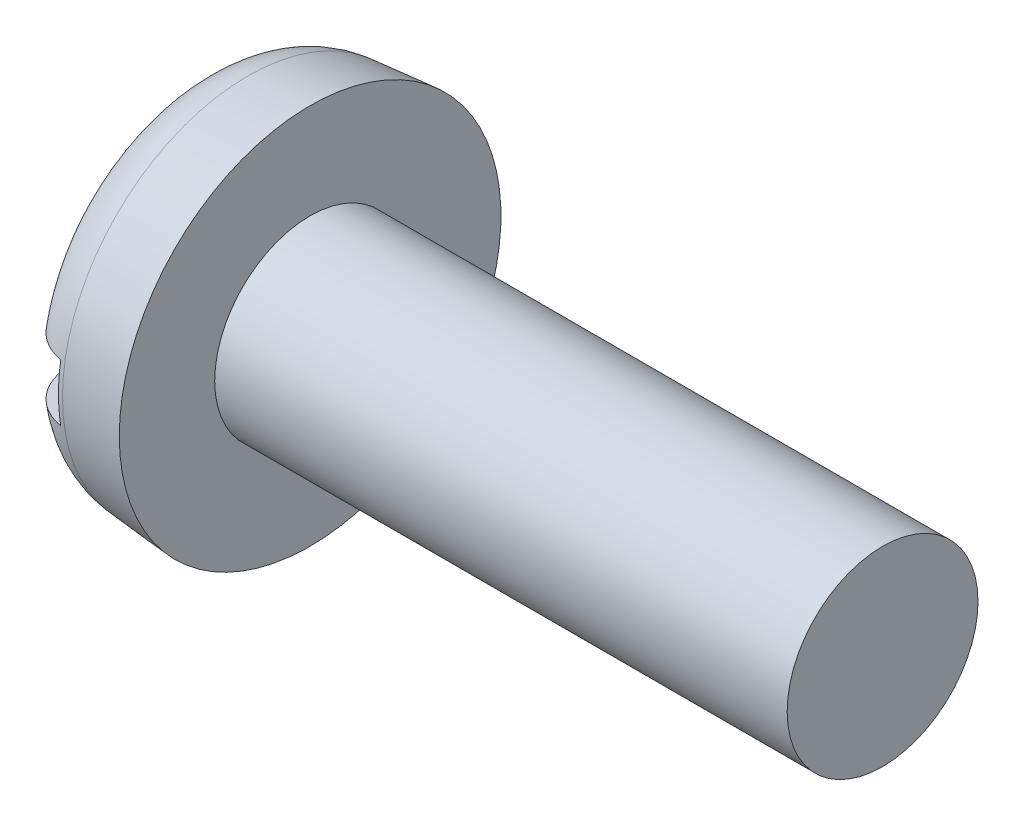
ISO-10303-21;
HEADER;
FILE_DESCRIPTION(('STEP AP214'),'2;1');
FILE_NAME('part.step','',(''),(''),'','','');
FILE_SCHEMA(('AUTOMOTIVE_DESIGN { 1 0 10303 214 1 1 1 1 }'));
ENDSEC;
DATA;
#1=APPLICATION_CONTEXT('core data for automotive mechanical design processes');
#2=APPLICATION_PROTOCOL_DEFINITION('international standard','automotive_design',2000,#1);
#3=PRODUCT_CONTEXT('',#1,'mechanical');
#4=PRODUCT('Part','Part','',(#3));
#5=PRODUCT_RELATED_PRODUCT_CATEGORY('part','',(#4));
#6=PRODUCT_DEFINITION_FORMATION('','',#4);
#7=PRODUCT_DEFINITION_CONTEXT('part definition',#1,'design');
#8=PRODUCT_DEFINITION('design','',#6,#7);
#9=PRODUCT_DEFINITION_SHAPE('','',#8);
#10=(LENGTH_UNIT() NAMED_UNIT(*) SI_UNIT(.MILLI.,.METRE.));
#11=(NAMED_UNIT(*) PLANE_ANGLE_UNIT() SI_UNIT($,.RADIAN.));
#12=(NAMED_UNIT(*) SI_UNIT($,.STERADIAN.) SOLID_ANGLE_UNIT());
#13=UNCERTAINTY_MEASURE_WITH_UNIT(LENGTH_MEASURE(1.E-05),#10,'distance_accuracy_value','');
#14=(GEOMETRIC_REPRESENTATION_CONTEXT(3) GLOBAL_UNCERTAINTY_ASSIGNED_CONTEXT((#13)) GLOBAL_UNIT_ASSIGNED_CONTEXT((#10,
#11,#12)) REPRESENTATION_CONTEXT('',''));
#15=CARTESIAN_POINT('',(0.,0.,0.));
#16=DIRECTION('',(0.,0.,1.));
#17=DIRECTION('',(1.,0.,0.));
#18=AXIS2_PLACEMENT_3D('',#15,#16,#17);
#19=CARTESIAN_POINT('',(0.,0.,0.));
#20=DIRECTION('',(-1.,0.,0.));
#21=DIRECTION('',(0.,0.,1.));
#22=AXIS2_PLACEMENT_3D('',#19,#20,#21);
#23=PLANE('',#22);
#24=DIRECTION('',(0.,0.,-1.));
#25=VECTOR('',#24,1.);
#26=CARTESIAN_POINT('',(0.,0.599999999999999,4.));
#27=LINE('',#26,#25);
#28=CARTESIAN_POINT('',(0.,0.599999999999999,2.62267277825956));
#29=VERTEX_POINT('',#28);
#30=CARTESIAN_POINT('',(0.,0.599999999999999,-2.62267277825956));
#31=VERTEX_POINT('',#30);
#32=EDGE_CURVE('E85',#29,#31,#27,.T.);
#33=ORIENTED_EDGE('',*,*,#32,.F.);
#34=CARTESIAN_POINT('',(0.,0.,0.));
#35=DIRECTION('',(-1.,0.,0.));
#36=DIRECTION('',(0.,0.,1.));
#37=AXIS2_PLACEMENT_3D('',#34,#35,#36);
#38=CIRCLE('',#37,2.69042979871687);
#39=EDGE_CURVE('E91',#29,#31,#38,.T.);
#40=ORIENTED_EDGE('',*,*,#39,.T.);
#41=EDGE_LOOP('',(#33,#40));
#42=FACE_BOUND('',#41,.T.);
#43=ADVANCED_FACE('F32',(#42),#23,.T.);
#44=CARTESIAN_POINT('',(-25.4,0.,0.));
#45=DIRECTION('',(-1.,0.,0.));
#46=DIRECTION('',(0.,0.,1.));
#47=AXIS2_PLACEMENT_3D('',#44,#45,#46);
#48=CYLINDRICAL_SURFACE('',#47,2.);
#49=CARTESIAN_POINT('',(14.4,0.,0.));
#50=DIRECTION('',(-1.,0.,0.));
#51=DIRECTION('',(0.,0.,1.));
#52=AXIS2_PLACEMENT_3D('',#49,#50,#51);
#53=CIRCLE('',#52,2.);
#54=CARTESIAN_POINT('',(14.4,0.,2.));
#55=VERTEX_POINT('',#54);
#56=EDGE_CURVE('E92',#55,#55,#53,.T.);
#57=ORIENTED_EDGE('',*,*,#56,.T.);
#58=EDGE_LOOP('',(#57));
#59=FACE_BOUND('',#58,.T.);
#60=CARTESIAN_POINT('',(2.4,0.,0.));
#61=DIRECTION('',(-1.,0.,0.));
#62=DIRECTION('',(0.,0.,1.));
#63=AXIS2_PLACEMENT_3D('',#60,#61,#62);
#64=CIRCLE('',#63,2.);
#65=CARTESIAN_POINT('',(2.4,0.,2.));
#66=VERTEX_POINT('',#65);
#67=EDGE_CURVE('E149',#66,#66,#64,.T.);
#68=ORIENTED_EDGE('',*,*,#67,.F.);
#69=EDGE_LOOP('',(#68));
#70=FACE_BOUND('',#69,.T.);
#71=ADVANCED_FACE('F137',(#59,#70),#48,.T.);
#72=CARTESIAN_POINT('',(14.4,2.,0.));
#73=DIRECTION('',(1.,0.,0.));
#74=DIRECTION('',(0.,0.,-1.));
#75=AXIS2_PLACEMENT_3D('',#72,#73,#74);
#76=PLANE('',#75);
#77=ORIENTED_EDGE('',*,*,#56,.F.);
#78=EDGE_LOOP('',(#77));
#79=FACE_BOUND('',#78,.T.);
#80=ADVANCED_FACE('F135',(#79),#76,.T.);
#81=DIRECTION('',(0.,0.,1.));
#82=VECTOR('',#81,1.);
#83=CARTESIAN_POINT('',(0.,-0.599999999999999,-4.));
#84=LINE('',#83,#82);
#85=CARTESIAN_POINT('',(0.,-0.6,-2.62267277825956));
#86=VERTEX_POINT('',#85);
#87=CARTESIAN_POINT('',(0.,-0.6,2.62267277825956));
#88=VERTEX_POINT('',#87);
#89=EDGE_CURVE('E76',#86,#88,#84,.T.);
#90=ORIENTED_EDGE('',*,*,#89,.F.);
#91=EDGE_CURVE('E83',#86,#88,#38,.T.);
#92=ORIENTED_EDGE('',*,*,#91,.T.);
#93=EDGE_LOOP('',(#90,#92));
#94=FACE_BOUND('',#93,.T.);
#95=ADVANCED_FACE('F82',(#94),#23,.T.);
#96=CARTESIAN_POINT('',(0.,0.,0.));
#97=DIRECTION('',(1.,0.,0.));
#98=DIRECTION('',(0.,0.,-1.));
#99=AXIS2_PLACEMENT_3D('',#96,#97,#98);
#100=CONICAL_SURFACE('',#99,3.79002720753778,0.0872664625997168);
#101=CARTESIAN_POINT('',(1.09541310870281,0.,0.));
#102=DIRECTION('',(-1.,0.,0.));
#103=DIRECTION('',(0.,0.,1.));
#104=AXIS2_PLACEMENT_3D('',#101,#102,#103);
#105=CIRCLE('',#104,3.88586343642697);
#106=CARTESIAN_POINT('',(1.09541310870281,0.,3.88586343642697));
#107=VERTEX_POINT('',#106);
#108=EDGE_CURVE('E95',#107,#107,#105,.F.);
#109=ORIENTED_EDGE('',*,*,#108,.T.);
#110=EDGE_LOOP('',(#109));
#111=FACE_BOUND('',#110,.T.);
#112=CARTESIAN_POINT('',(2.4,0.,0.));
#113=DIRECTION('',(-1.,0.,0.));
#114=DIRECTION('',(0.,0.,1.));
#115=AXIS2_PLACEMENT_3D('',#112,#113,#114);
#116=CIRCLE('',#115,4.);
#117=CARTESIAN_POINT('',(2.4,0.,4.));
#118=VERTEX_POINT('',#117);
#119=EDGE_CURVE('E97',#118,#118,#116,.T.);
#120=ORIENTED_EDGE('',*,*,#119,.T.);
#121=EDGE_LOOP('',(#120));
#122=FACE_BOUND('',#121,.T.);
#123=ADVANCED_FACE('F128',(#111,#122),#100,.T.);
#124=CARTESIAN_POINT('',(2.4,2.,0.));
#125=DIRECTION('',(-1.,0.,0.));
#126=DIRECTION('',(0.,0.,1.));
#127=AXIS2_PLACEMENT_3D('',#124,#125,#126);
#128=PLANE('',#127);
#129=ORIENTED_EDGE('',*,*,#119,.F.);
#130=EDGE_LOOP('',(#129));
#131=FACE_BOUND('',#130,.T.);
#132=ORIENTED_EDGE('',*,*,#67,.T.);
#133=EDGE_LOOP('',(#132));
#134=FACE_BOUND('',#133,.T.);
#135=ADVANCED_FACE('F124',(#131,#134),#128,.F.);
#136=CARTESIAN_POINT('',(1.2,0.,0.));
#137=DIRECTION('',(-1.,0.,0.));
#138=DIRECTION('',(0.,0.,1.));
#139=AXIS2_PLACEMENT_3D('',#136,#137,#138);
#140=TOROIDAL_SURFACE('',#139,2.69042979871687,1.2);
#141=CARTESIAN_POINT('',(0.3865043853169,0.599999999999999,-3.52185650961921));
#142=CARTESIAN_POINT('',(0.435468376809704,0.599999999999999,-3.56765543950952));
#143=CARTESIAN_POINT('',(0.48830443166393,0.599999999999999,-3.60938194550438));
#144=CARTESIAN_POINT('',(0.600265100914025,0.599999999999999,-3.68342203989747));
#145=CARTESIAN_POINT('',(0.659396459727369,0.599999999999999,-3.71572539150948));
#146=CARTESIAN_POINT('',(0.782252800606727,0.599999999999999,-3.76991557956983));
#147=CARTESIAN_POINT('',(0.845977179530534,0.599999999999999,-3.79180378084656));
#148=CARTESIAN_POINT('',(0.976191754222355,0.599999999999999,-3.82450279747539));
#149=CARTESIAN_POINT('',(1.04268130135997,0.599999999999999,-3.83531619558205));
#150=CARTESIAN_POINT('',(1.1761990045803,0.599999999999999,-3.84552483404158));
#151=CARTESIAN_POINT('',(1.2432228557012,0.599999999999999,-3.84497642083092));
#152=CARTESIAN_POINT('',(1.37622462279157,0.599999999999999,-3.83261582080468));
#153=CARTESIAN_POINT('',(1.44220252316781,0.599999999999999,-3.82080346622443));
#154=CARTESIAN_POINT('',(1.57113854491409,0.599999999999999,-3.7862937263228));
#155=CARTESIAN_POINT('',(1.63410108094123,0.599999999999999,-3.76361282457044));
#156=CARTESIAN_POINT('',(1.75534617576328,0.599999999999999,-3.70804459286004));
#157=CARTESIAN_POINT('',(1.81362870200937,0.599999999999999,-3.67515719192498));
#158=CARTESIAN_POINT('',(1.92413366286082,0.599999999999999,-3.5999836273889));
#159=CARTESIAN_POINT('',(1.97632984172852,0.599999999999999,-3.55765888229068));
#160=CARTESIAN_POINT('',(2.07296076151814,0.599999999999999,-3.46492588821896));
#161=CARTESIAN_POINT('',(2.11739523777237,0.599999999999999,-3.4145173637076));
#162=CARTESIAN_POINT('',(2.19773705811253,0.599999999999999,-3.30652404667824));
#163=CARTESIAN_POINT('',(2.2335546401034,0.599999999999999,-3.24887250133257));
#164=CARTESIAN_POINT('',(2.29517588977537,0.599999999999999,-3.12844912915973));
#165=CARTESIAN_POINT('',(2.32097889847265,0.599999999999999,-3.06567696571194));
#166=CARTESIAN_POINT('',(2.36230436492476,0.599999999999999,-2.93572304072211));
#167=CARTESIAN_POINT('',(2.37765465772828,0.599999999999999,-2.86848656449));
#168=CARTESIAN_POINT('',(2.39710654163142,0.599999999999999,-2.73240889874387));
#169=CARTESIAN_POINT('',(2.40120699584,0.599999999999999,-2.66356754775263));
#170=CARTESIAN_POINT('',(2.39814758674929,0.599999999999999,-2.52464946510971));
#171=CARTESIAN_POINT('',(2.39074269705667,0.599999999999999,-2.45457815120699));
#172=CARTESIAN_POINT('',(2.36454808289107,0.599999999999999,-2.31659764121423));
#173=CARTESIAN_POINT('',(2.34575688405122,0.599999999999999,-2.24868872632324));
#174=CARTESIAN_POINT('',(2.29682890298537,0.599999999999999,-2.11531585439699));
#175=CARTESIAN_POINT('',(2.26644200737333,0.599999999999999,-2.04994358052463));
#176=CARTESIAN_POINT('',(2.19524076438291,0.599999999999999,-1.92513363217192));
#177=CARTESIAN_POINT('',(2.15442449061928,0.599999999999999,-1.86569705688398));
#178=CARTESIAN_POINT('',(2.06294283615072,0.599999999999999,-1.75389115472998));
#179=CARTESIAN_POINT('',(2.01217853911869,0.599999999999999,-1.70160258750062));
#180=CARTESIAN_POINT('',(1.90235992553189,0.599999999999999,-1.60657192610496));
#181=CARTESIAN_POINT('',(1.84330597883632,0.599999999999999,-1.56382940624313));
#182=CARTESIAN_POINT('',(1.72028944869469,0.599999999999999,-1.49071034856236));
#183=CARTESIAN_POINT('',(1.65652070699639,0.599999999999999,-1.46000898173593));
#184=CARTESIAN_POINT('',(1.52445964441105,0.599999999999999,-1.41076217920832));
#185=CARTESIAN_POINT('',(1.45617085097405,0.599999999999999,-1.39220738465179));
#186=CARTESIAN_POINT('',(1.32258878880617,0.599999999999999,-1.3692588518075));
#187=CARTESIAN_POINT('',(1.25746124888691,0.599999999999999,-1.36389765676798));
#188=CARTESIAN_POINT('',(1.12729576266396,0.599999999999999,-1.36480396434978));
#189=CARTESIAN_POINT('',(1.06225779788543,0.599999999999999,-1.37106853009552));
#190=CARTESIAN_POINT('',(0.937361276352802,0.599999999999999,-1.39427975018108));
#191=CARTESIAN_POINT('',(0.877403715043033,0.599999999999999,-1.41070181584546));
#192=CARTESIAN_POINT('',(0.760914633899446,0.599999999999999,-1.45296891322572));
#193=CARTESIAN_POINT('',(0.704383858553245,0.599999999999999,-1.47881598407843));
#194=CARTESIAN_POINT('',(0.59370506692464,0.599999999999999,-1.54020998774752));
#195=CARTESIAN_POINT('',(0.539760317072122,0.599999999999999,-1.57612236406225));
#196=CARTESIAN_POINT('',(0.438104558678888,0.599999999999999,-1.65588570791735));
#197=CARTESIAN_POINT('',(0.390395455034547,0.599999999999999,-1.69973909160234));
#198=CARTESIAN_POINT('',(0.298820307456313,0.599999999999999,-1.79776253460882));
#199=CARTESIAN_POINT('',(0.255521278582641,0.599999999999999,-1.85246315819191));
#200=CARTESIAN_POINT('',(0.178283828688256,0.599999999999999,-1.96812037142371));
#201=CARTESIAN_POINT('',(0.144347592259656,0.599999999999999,-2.02907841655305));
#202=CARTESIAN_POINT('',(0.0855336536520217,0.599999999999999,-2.15824220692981));
#203=CARTESIAN_POINT('',(0.0610804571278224,0.599999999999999,-2.22664188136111));
#204=CARTESIAN_POINT('',(0.0240295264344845,0.599999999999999,-2.36658228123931));
#205=CARTESIAN_POINT('',(0.0114315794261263,0.599999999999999,-2.43812295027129));
#206=CARTESIAN_POINT('',(-0.00140349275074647,0.599999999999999,-2.58214276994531));
#207=CARTESIAN_POINT('',(-0.00166960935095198,0.599999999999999,-2.65461931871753));
#208=CARTESIAN_POINT('',(0.0102529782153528,0.599999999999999,-2.79856484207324));
#209=CARTESIAN_POINT('',(0.0224436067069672,0.599999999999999,-2.87003365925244));
#210=CARTESIAN_POINT('',(0.0586721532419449,0.599999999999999,-3.00828260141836));
#211=CARTESIAN_POINT('',(0.082454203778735,0.599999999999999,-3.07512990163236));
#212=CARTESIAN_POINT('',(0.141152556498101,0.599999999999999,-3.20367573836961));
#213=CARTESIAN_POINT('',(0.176053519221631,0.599999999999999,-3.26538122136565));
#214=CARTESIAN_POINT('',(0.240740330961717,0.599999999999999,-3.35956174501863));
#215=CARTESIAN_POINT('',(0.267410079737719,0.599999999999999,-3.39421743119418));
#216=CARTESIAN_POINT('',(0.324340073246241,0.599999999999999,-3.46044388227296));
#217=CARTESIAN_POINT('',(0.354600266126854,0.599999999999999,-3.49201469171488));
#218=CARTESIAN_POINT('',(0.3865043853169,0.599999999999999,-3.52185650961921));
#219=B_SPLINE_CURVE_WITH_KNOTS('',3,(#141,#142,#143,#144,#145,#146,#147,#148,#149,#150,#151,
#152,#153,#154,#155,#156,#157,#158,#159,#160,#161,#162,#163,#164,#165,#166,#167,#168,#169,#170,
#171,#172,#173,#174,#175,#176,#177,#178,#179,#180,#181,#182,#183,#184,#185,#186,#187,#188,#189,
#190,#191,#192,#193,#194,#195,#196,#197,#198,#199,#200,#201,#202,#203,#204,#205,#206,#207,#208,
#209,#210,#211,#212,#213,#214,#215,#216,#217,#218),.UNSPECIFIED.,.T.,.F.,(4,2,2,2,2,2,2,2,2,2,2,
2,2,2,2,2,2,2,2,2,2,2,2,2,2,2,2,2,2,2,2,2,2,2,2,2,2,2,4),(0.,0.200976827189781,
0.402171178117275,0.603339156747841,0.804460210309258,1.0045840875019,1.2047109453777,
1.40453524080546,1.60436092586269,1.80501901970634,2.00568395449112,2.2083565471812,
2.41104247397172,2.61699090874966,2.82296015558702,3.03337636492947,3.24381982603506,
3.45908552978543,3.67439102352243,3.8919572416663,4.10951375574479,4.32071351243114,
4.53175034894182,4.72677835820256,4.92175710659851,5.10742155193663,5.29312619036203,
5.48672044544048,5.68037370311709,5.88873369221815,6.09714225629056,6.31402614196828,
6.53090613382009,6.74727622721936,6.96367975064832,7.17550906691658,7.38704740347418,
7.51800243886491,7.64895558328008),.UNSPECIFIED.);
#220=CARTESIAN_POINT('',(1.,0.599999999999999,-3.8268957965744));
#221=VERTEX_POINT('',#220);
#222=EDGE_CURVE('E11',#31,#221,#219,.T.);
#223=ORIENTED_EDGE('',*,*,#222,.F.);
#224=ORIENTED_EDGE('',*,*,#39,.F.);
#225=CARTESIAN_POINT('',(0.568676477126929,0.599999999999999,1.55841219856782));
#226=CARTESIAN_POINT('',(0.622454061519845,0.599999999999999,1.52276443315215));
#227=CARTESIAN_POINT('',(0.679085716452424,0.599999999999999,1.49137245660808));
#228=CARTESIAN_POINT('',(0.796770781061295,0.599999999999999,1.43831139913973));
#229=CARTESIAN_POINT('',(0.857825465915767,0.599999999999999,1.41664513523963));
#230=CARTESIAN_POINT('',(0.982921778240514,0.599999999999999,1.38402811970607));
#231=CARTESIAN_POINT('',(1.04697051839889,0.599999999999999,1.37310440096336));
#232=CARTESIAN_POINT('',(1.17597937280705,0.599999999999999,1.36268675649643));
#233=CARTESIAN_POINT('',(1.24093916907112,0.599999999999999,1.36318893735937));
#234=CARTESIAN_POINT('',(1.36722529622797,0.599999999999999,1.37533615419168));
#235=CARTESIAN_POINT('',(1.42859438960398,0.599999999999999,1.38654477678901));
#236=CARTESIAN_POINT('',(1.54865022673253,0.599999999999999,1.41889802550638));
#237=CARTESIAN_POINT('',(1.60733638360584,0.599999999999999,1.44004481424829));
#238=CARTESIAN_POINT('',(1.72180457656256,0.599999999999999,1.49189888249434));
#239=CARTESIAN_POINT('',(1.77749881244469,0.599999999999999,1.52279911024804));
#240=CARTESIAN_POINT('',(1.88340638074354,0.599999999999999,1.59287167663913));
#241=CARTESIAN_POINT('',(1.93361816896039,0.599999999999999,1.63204633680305));
#242=CARTESIAN_POINT('',(2.03113053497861,0.599999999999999,1.7207614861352));
#243=CARTESIAN_POINT('',(2.07792119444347,0.599999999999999,1.77086293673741));
#244=CARTESIAN_POINT('',(2.16295007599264,0.599999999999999,1.87786529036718));
#245=CARTESIAN_POINT('',(2.20118595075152,0.599999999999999,1.93476805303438));
#246=CARTESIAN_POINT('',(2.26997158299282,0.599999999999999,2.05705672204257));
#247=CARTESIAN_POINT('',(2.30000838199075,0.599999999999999,2.12273201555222));
#248=CARTESIAN_POINT('',(2.34872218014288,0.599999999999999,2.25817360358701));
#249=CARTESIAN_POINT('',(2.36739836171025,0.599999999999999,2.32794019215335));
#250=CARTESIAN_POINT('',(2.39284815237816,0.599999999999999,2.47012141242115));
#251=CARTESIAN_POINT('',(2.3995382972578,0.599999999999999,2.54255105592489));
#252=CARTESIAN_POINT('',(2.40041533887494,0.599999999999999,2.68749005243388));
#253=CARTESIAN_POINT('',(2.39460324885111,0.599999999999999,2.75999939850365));
#254=CARTESIAN_POINT('',(2.37072428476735,0.599999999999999,2.90156578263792));
#255=CARTESIAN_POINT('',(2.35289092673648,0.599999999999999,2.97066215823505));
#256=CARTESIAN_POINT('',(2.3055955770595,0.599999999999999,3.10475609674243));
#257=CARTESIAN_POINT('',(2.2761350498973,0.599999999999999,3.16975417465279));
#258=CARTESIAN_POINT('',(2.20718370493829,0.599999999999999,3.29217559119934));
#259=CARTESIAN_POINT('',(2.16794580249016,0.599999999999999,3.34974141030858));
#260=CARTESIAN_POINT('',(2.08018656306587,0.599999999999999,3.45730019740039));
#261=CARTESIAN_POINT('',(2.03166624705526,0.599999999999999,3.50729399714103));
#262=CARTESIAN_POINT('',(1.92773605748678,0.599999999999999,3.59728886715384));
#263=CARTESIAN_POINT('',(1.87247613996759,0.599999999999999,3.63746317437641));
#264=CARTESIAN_POINT('',(1.75592540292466,0.599999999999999,3.70782235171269));
#265=CARTESIAN_POINT('',(1.69463504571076,0.599999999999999,3.73800798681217));
#266=CARTESIAN_POINT('',(1.5686108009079,0.599999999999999,3.78714975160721));
#267=CARTESIAN_POINT('',(1.50393088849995,0.599999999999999,3.80624437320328));
#268=CARTESIAN_POINT('',(1.37227430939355,0.599999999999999,3.83322369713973));
#269=CARTESIAN_POINT('',(1.30529774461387,0.599999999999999,3.84110889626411));
#270=CARTESIAN_POINT('',(1.17141837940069,0.599999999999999,3.845417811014));
#271=CARTESIAN_POINT('',(1.10451797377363,0.599999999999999,3.841916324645));
#272=CARTESIAN_POINT('',(0.972258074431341,0.599999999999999,3.82372114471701));
#273=CARTESIAN_POINT('',(0.906898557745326,0.599999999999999,3.80902761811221));
#274=CARTESIAN_POINT('',(0.779620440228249,0.599999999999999,3.76890152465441));
#275=CARTESIAN_POINT('',(0.717699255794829,0.599999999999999,3.74347714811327));
#276=CARTESIAN_POINT('',(0.598976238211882,0.599999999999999,3.68264222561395));
#277=CARTESIAN_POINT('',(0.542174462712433,0.599999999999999,3.64723156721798));
#278=CARTESIAN_POINT('',(0.434989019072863,0.599999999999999,3.56726339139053));
#279=CARTESIAN_POINT('',(0.384638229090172,0.599999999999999,3.5226618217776));
#280=CARTESIAN_POINT('',(0.292043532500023,0.599999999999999,3.42571932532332));
#281=CARTESIAN_POINT('',(0.249799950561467,0.599999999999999,3.37337808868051));
#282=CARTESIAN_POINT('',(0.174110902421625,0.599999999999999,3.26185326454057));
#283=CARTESIAN_POINT('',(0.140765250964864,0.599999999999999,3.20260196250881));
#284=CARTESIAN_POINT('',(0.0843091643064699,0.599999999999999,3.07941230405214));
#285=CARTESIAN_POINT('',(0.0611994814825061,0.599999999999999,3.01547360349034));
#286=CARTESIAN_POINT('',(0.0254327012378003,0.599999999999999,2.88357716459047));
#287=CARTESIAN_POINT('',(0.0129588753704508,0.599999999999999,2.81556976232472));
#288=CARTESIAN_POINT('',(-0.000658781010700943,0.599999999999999,2.67843562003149));
#289=CARTESIAN_POINT('',(-0.00180186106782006,0.599999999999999,2.60930880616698));
#290=CARTESIAN_POINT('',(0.00723867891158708,0.599999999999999,2.47027110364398));
#291=CARTESIAN_POINT('',(0.0176724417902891,0.599999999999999,2.40037650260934));
#292=CARTESIAN_POINT('',(0.0498636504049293,0.599999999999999,2.2632278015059));
#293=CARTESIAN_POINT('',(0.0716251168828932,0.599999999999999,2.19597464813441));
#294=CARTESIAN_POINT('',(0.126425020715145,0.599999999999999,2.06442921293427));
#295=CARTESIAN_POINT('',(0.159709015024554,0.599999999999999,2.00023925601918));
#296=CARTESIAN_POINT('',(0.236484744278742,0.599999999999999,1.87833288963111));
#297=CARTESIAN_POINT('',(0.279968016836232,0.599999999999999,1.82061117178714));
#298=CARTESIAN_POINT('',(0.363480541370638,0.599999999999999,1.7273106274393));
#299=CARTESIAN_POINT('',(0.401461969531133,0.599999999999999,1.68987927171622));
#300=CARTESIAN_POINT('',(0.481873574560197,0.599999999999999,1.62013708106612));
#301=CARTESIAN_POINT('',(0.524303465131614,0.599999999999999,1.58782591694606));
#302=CARTESIAN_POINT('',(0.568676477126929,0.599999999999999,1.55841219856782));
#303=B_SPLINE_CURVE_WITH_KNOTS('',3,(#225,#226,#227,#228,#229,#230,#231,#232,#233,#234,#235,
#236,#237,#238,#239,#240,#241,#242,#243,#244,#245,#246,#247,#248,#249,#250,#251,#252,#253,#254,
#255,#256,#257,#258,#259,#260,#261,#262,#263,#264,#265,#266,#267,#268,#269,#270,#271,#272,#273,
#274,#275,#276,#277,#278,#279,#280,#281,#282,#283,#284,#285,#286,#287,#288,#289,#290,#291,#292,
#293,#294,#295,#296,#297,#298,#299,#300,#301,#302),.UNSPECIFIED.,.T.,.F.,(4,2,2,2,2,2,2,2,2,2,2,
2,2,2,2,2,2,2,2,2,2,2,2,2,2,2,2,2,2,2,2,2,2,2,2,2,2,2,4),(0.,0.193385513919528,
0.386827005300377,0.580754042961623,0.774615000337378,0.960896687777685,1.14721893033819,
1.33748625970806,1.52780704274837,1.73256769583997,1.93738446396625,2.15302491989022,
2.3686808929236,2.58583282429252,2.80296715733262,3.01600070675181,3.22900743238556,
3.43699107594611,3.64495185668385,3.84892478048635,4.05288207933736,4.25423457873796,
4.45557815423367,4.65560180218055,4.85562246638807,5.05549074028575,5.25536126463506,
5.45621303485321,5.6570728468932,5.86009921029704,6.06314049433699,6.26961358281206,
6.47610034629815,6.68713711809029,6.89824884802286,7.11416888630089,7.3299104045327,
7.4894871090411,7.64905354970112),.UNSPECIFIED.);
#304=CARTESIAN_POINT('',(1.,0.599999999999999,3.8268957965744));
#305=VERTEX_POINT('',#304);
#306=EDGE_CURVE('E109',#305,#29,#303,.T.);
#307=ORIENTED_EDGE('',*,*,#306,.F.);
#308=CARTESIAN_POINT('',(1.,0.,0.));
#309=DIRECTION('',(-1.,0.,0.));
#310=DIRECTION('',(0.,0.,1.));
#311=AXIS2_PLACEMENT_3D('',#308,#309,#310);
#312=CIRCLE('',#311,3.8736457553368);
#313=CARTESIAN_POINT('',(1.,-0.600000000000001,3.8268957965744));
#314=VERTEX_POINT('',#313);
#315=EDGE_CURVE('E103',#305,#314,#312,.F.);
#316=ORIENTED_EDGE('',*,*,#315,.T.);
#317=CARTESIAN_POINT('',(0.568676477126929,-0.6,1.55841219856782));
#318=CARTESIAN_POINT('',(0.509332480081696,-0.6,1.59775463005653));
#319=CARTESIAN_POINT('',(0.453379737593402,-0.6,1.64234041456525));
#320=CARTESIAN_POINT('',(0.349719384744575,-0.6,1.74035526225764));
#321=CARTESIAN_POINT('',(0.302029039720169,-0.6,1.79380239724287));
#322=CARTESIAN_POINT('',(0.216237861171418,-0.6,1.90774469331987));
#323=CARTESIAN_POINT('',(0.178118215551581,-0.6,1.96822568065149));
#324=CARTESIAN_POINT('',(0.112363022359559,-0.6,2.0946004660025));
#325=CARTESIAN_POINT('',(0.0847225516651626,-0.6,2.16049170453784));
#326=CARTESIAN_POINT('',(0.0402688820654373,-0.6,2.29725613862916));
#327=CARTESIAN_POINT('',(0.0236758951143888,-0.6,2.36820113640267));
#328=CARTESIAN_POINT('',(0.00278349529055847,-0.6,2.51189141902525));
#329=CARTESIAN_POINT('',(-0.00151505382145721,-0.6,2.58463683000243));
#330=CARTESIAN_POINT('',(0.00243750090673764,-0.6,2.72894600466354));
#331=CARTESIAN_POINT('',(0.010543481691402,-0.6,2.80051368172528));
#332=CARTESIAN_POINT('',(0.0389520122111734,-0.6,2.94118836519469));
#333=CARTESIAN_POINT('',(0.0592529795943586,-0.6,3.01029568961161));
#334=CARTESIAN_POINT('',(0.110960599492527,-0.6,3.1423581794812));
#335=CARTESIAN_POINT('',(0.142096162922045,-0.6,3.20541948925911));
#336=CARTESIAN_POINT('',(0.214736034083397,-0.6,3.32525905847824));
#337=CARTESIAN_POINT('',(0.256239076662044,-0.6,3.38203808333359));
#338=CARTESIAN_POINT('',(0.347460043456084,-0.6,3.48641848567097));
#339=CARTESIAN_POINT('',(0.396982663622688,-0.6,3.53419059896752));
#340=CARTESIAN_POINT('',(0.503454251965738,-0.6,3.62058393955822));
#341=CARTESIAN_POINT('',(0.560402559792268,-0.600000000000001,3.6592059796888));
#342=CARTESIAN_POINT('',(0.67915616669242,-0.600000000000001,3.72559524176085));
#343=CARTESIAN_POINT('',(0.740873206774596,-0.600000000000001,3.75352040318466));
#344=CARTESIAN_POINT('',(0.868147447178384,-0.600000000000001,3.79850563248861));
#345=CARTESIAN_POINT('',(0.933704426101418,-0.600000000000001,3.81556632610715));
#346=CARTESIAN_POINT('',(1.06616217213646,-0.600000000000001,3.83820251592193));
#347=CARTESIAN_POINT('',(1.13304550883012,-0.600000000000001,3.84388011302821));
#348=CARTESIAN_POINT('',(1.26681198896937,-0.600000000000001,3.84388783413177));
#349=CARTESIAN_POINT('',(1.33369513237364,-0.600000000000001,3.83821825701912));
#350=CARTESIAN_POINT('',(1.46534857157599,-0.600000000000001,3.81573676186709));
#351=CARTESIAN_POINT('',(1.5301247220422,-0.600000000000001,3.79895909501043));
#352=CARTESIAN_POINT('',(1.65595122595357,-0.600000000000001,3.75479405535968));
#353=CARTESIAN_POINT('',(1.7170015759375,-0.600000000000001,3.72740667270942));
#354=CARTESIAN_POINT('',(1.83382644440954,-0.600000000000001,3.66274505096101));
#355=CARTESIAN_POINT('',(1.88958679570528,-0.6,3.62544522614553));
#356=CARTESIAN_POINT('',(1.99411858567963,-0.6,3.54208564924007));
#357=CARTESIAN_POINT('',(2.04288982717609,-0.6,3.49602565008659));
#358=CARTESIAN_POINT('',(2.1325144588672,-0.6,3.39605796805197));
#359=CARTESIAN_POINT('',(2.17329813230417,-0.6,3.34208780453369));
#360=CARTESIAN_POINT('',(2.245373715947,-0.6,3.22814724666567));
#361=CARTESIAN_POINT('',(2.27666509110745,-0.6,3.16817651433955));
#362=CARTESIAN_POINT('',(2.32937247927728,-0.6,3.04302336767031));
#363=CARTESIAN_POINT('',(2.35063955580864,-0.6,2.97777826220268));
#364=CARTESIAN_POINT('',(2.3821555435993,-0.6,2.84468257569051));
#365=CARTESIAN_POINT('',(2.39240345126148,-0.6,2.77683175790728));
#366=CARTESIAN_POINT('',(2.40182781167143,-0.6,2.6389851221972));
#367=CARTESIAN_POINT('',(2.40077563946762,-0.6,2.56897370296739));
#368=CARTESIAN_POINT('',(2.38721389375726,-0.6,2.43007140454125));
#369=CARTESIAN_POINT('',(2.37470291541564,-0.6,2.36118066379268));
#370=CARTESIAN_POINT('',(2.33824897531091,-0.6,2.22476443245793));
#371=CARTESIAN_POINT('',(2.31404566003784,-0.6,2.15730848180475));
#372=CARTESIAN_POINT('',(2.25484108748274,-0.6,2.02730649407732));
#373=CARTESIAN_POINT('',(2.21983804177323,-0.6,1.96476127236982));
#374=CARTESIAN_POINT('',(2.13932874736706,-0.6,1.8453529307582));
#375=CARTESIAN_POINT('',(2.09366234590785,-0.6,1.78859760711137));
#376=CARTESIAN_POINT('',(1.99331431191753,-0.6,1.68367587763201));
#377=CARTESIAN_POINT('',(1.93863170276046,-0.6,1.63551040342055));
#378=CARTESIAN_POINT('',(1.82254625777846,-0.6,1.55016942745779));
#379=CARTESIAN_POINT('',(1.7612597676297,-0.6,1.51283623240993));
#380=CARTESIAN_POINT('',(1.6329601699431,-0.6,1.44984263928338));
#381=CARTESIAN_POINT('',(1.56595104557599,-0.6,1.42417419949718));
#382=CARTESIAN_POINT('',(1.43290073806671,-0.6,1.38720166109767));
#383=CARTESIAN_POINT('',(1.36709528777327,-0.6,1.37505067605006));
#384=CARTESIAN_POINT('',(1.23436273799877,-0.6,1.3628486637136));
#385=CARTESIAN_POINT('',(1.16743586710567,-0.6,1.36279519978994));
#386=CARTESIAN_POINT('',(1.03904581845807,-0.6,1.37438428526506));
#387=CARTESIAN_POINT('',(0.97751125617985,-0.6,1.38526326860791));
#388=CARTESIAN_POINT('',(0.857136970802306,-0.6,1.41700902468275));
#389=CARTESIAN_POINT('',(0.79829431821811,-0.6,1.43786464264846));
#390=CARTESIAN_POINT('',(0.711456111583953,-0.6,1.47666141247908));
#391=CARTESIAN_POINT('',(0.681965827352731,-0.6,1.49136190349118));
#392=CARTESIAN_POINT('',(0.624300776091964,-0.6,1.52313858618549));
#393=CARTESIAN_POINT('',(0.596125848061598,-0.6,1.54021448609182));
#394=CARTESIAN_POINT('',(0.568676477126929,-0.6,1.55841219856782));
#395=B_SPLINE_CURVE_WITH_KNOTS('',3,(#317,#318,#319,#320,#321,#322,#323,#324,#325,#326,#327,
#328,#329,#330,#331,#332,#333,#334,#335,#336,#337,#338,#339,#340,#341,#342,#343,#344,#345,#346,
#347,#348,#349,#350,#351,#352,#353,#354,#355,#356,#357,#358,#359,#360,#361,#362,#363,#364,#365,
#366,#367,#368,#369,#370,#371,#372,#373,#374,#375,#376,#377,#378,#379,#380,#381,#382,#383,#384,
#385,#386,#387,#388,#389,#390,#391,#392,#393,#394),.UNSPECIFIED.,.T.,.F.,(4,2,2,2,2,2,2,2,2,2,2,
2,2,2,2,2,2,2,2,2,2,2,2,2,2,2,2,2,2,2,2,2,2,2,2,2,2,2,4),(0.,0.2134759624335,0.427392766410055,
0.640885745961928,0.854278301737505,1.07180637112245,1.28934972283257,1.50436737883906,
1.71935714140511,1.92931435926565,2.13924596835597,2.34467456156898,2.55008489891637,
2.75233330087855,2.95457005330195,3.15498457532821,3.355393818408,3.55518797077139,
3.75498230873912,3.95529744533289,4.15561823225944,4.35761633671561,4.55962582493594,
4.76454879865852,4.96949043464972,5.17858616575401,5.38770753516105,5.60171647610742,
5.815760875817,6.03325422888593,6.25077115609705,6.46494128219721,6.67896353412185,
6.87865214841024,7.07830054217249,7.26491113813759,7.4513135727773,7.55006829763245,
7.64881090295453),.UNSPECIFIED.);
#396=EDGE_CURVE('E90',#88,#314,#395,.T.);
#397=ORIENTED_EDGE('',*,*,#396,.F.);
#398=ORIENTED_EDGE('',*,*,#91,.F.);
#399=CARTESIAN_POINT('',(0.3865043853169,-0.6,-3.52185650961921));
#400=CARTESIAN_POINT('',(0.336558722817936,-0.6,-3.47513075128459));
#401=CARTESIAN_POINT('',(0.290567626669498,-0.6,-3.42409544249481));
#402=CARTESIAN_POINT('',(0.207816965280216,-0.6,-3.31495007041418));
#403=CARTESIAN_POINT('',(0.171070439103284,-0.6,-3.2568301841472));
#404=CARTESIAN_POINT('',(0.107859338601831,-0.6,-3.13533662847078));
#405=CARTESIAN_POINT('',(0.081381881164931,-0.6,-3.07196966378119));
#406=CARTESIAN_POINT('',(0.0392838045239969,-0.6,-2.94175448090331));
#407=CARTESIAN_POINT('',(0.0236604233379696,-0.6,-2.87490715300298));
#408=CARTESIAN_POINT('',(0.00341113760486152,-0.6,-2.73858284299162));
#409=CARTESIAN_POINT('',(-0.00105268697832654,-0.6,-2.66908182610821));
#410=CARTESIAN_POINT('',(0.00147102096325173,-0.6,-2.53028718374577));
#411=CARTESIAN_POINT('',(0.00846038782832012,-0.6,-2.46099359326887));
#412=CARTESIAN_POINT('',(0.0338721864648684,-0.6,-2.3228723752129));
#413=CARTESIAN_POINT('',(0.052556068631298,-0.6,-2.25409284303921));
#414=CARTESIAN_POINT('',(0.100979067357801,-0.6,-2.12053875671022));
#415=CARTESIAN_POINT('',(0.13071979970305,-0.6,-2.05576478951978));
#416=CARTESIAN_POINT('',(0.201105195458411,-0.6,-1.93075930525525));
#417=CARTESIAN_POINT('',(0.241951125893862,-0.6,-1.87064095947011));
#418=CARTESIAN_POINT('',(0.333200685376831,-0.6,-1.75812796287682));
#419=CARTESIAN_POINT('',(0.383605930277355,-0.6,-1.70573462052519));
#420=CARTESIAN_POINT('',(0.49243046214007,-0.6,-1.61063718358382));
#421=CARTESIAN_POINT('',(0.550808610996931,-0.6,-1.5678861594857));
#422=CARTESIAN_POINT('',(0.674249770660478,-0.6,-1.49345451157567));
#423=CARTESIAN_POINT('',(0.739309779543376,-0.6,-1.46176894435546));
#424=CARTESIAN_POINT('',(0.870462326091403,-0.6,-1.41247032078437));
#425=CARTESIAN_POINT('',(0.936297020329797,-0.6,-1.39417366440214));
#426=CARTESIAN_POINT('',(1.0701878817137,-0.6,-1.36992148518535));
#427=CARTESIAN_POINT('',(1.13824253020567,-0.6,-1.36395769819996));
#428=CARTESIAN_POINT('',(1.26912997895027,-0.6,-1.36469761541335));
#429=CARTESIAN_POINT('',(1.33196990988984,-0.6,-1.37048080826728));
#430=CARTESIAN_POINT('',(1.45576558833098,-0.6,-1.39257493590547));
#431=CARTESIAN_POINT('',(1.51672119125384,-0.6,-1.40888667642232));
#432=CARTESIAN_POINT('',(1.63489640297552,-0.6,-1.45115860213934));
#433=CARTESIAN_POINT('',(1.6921296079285,-0.6,-1.47708105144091));
#434=CARTESIAN_POINT('',(1.80183592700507,-0.6,-1.53754737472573));
#435=CARTESIAN_POINT('',(1.85430778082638,-0.6,-1.57209352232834));
#436=CARTESIAN_POINT('',(1.95690912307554,-0.6,-1.65139148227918));
#437=CARTESIAN_POINT('',(2.00661704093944,-0.6,-1.69668868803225));
#438=CARTESIAN_POINT('',(2.09829662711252,-0.6,-1.79453297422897));
#439=CARTESIAN_POINT('',(2.14026595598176,-0.6,-1.84708223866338));
#440=CARTESIAN_POINT('',(2.21793843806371,-0.6,-1.96160125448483));
#441=CARTESIAN_POINT('',(2.25307298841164,-0.6,-2.02395766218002));
#442=CARTESIAN_POINT('',(2.31259182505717,-0.6,-2.15361082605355));
#443=CARTESIAN_POINT('',(2.33697474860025,-0.6,-2.22090820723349));
#444=CARTESIAN_POINT('',(2.37457912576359,-0.6,-2.35984116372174));
#445=CARTESIAN_POINT('',(2.38759592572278,-0.6,-2.43153235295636));
#446=CARTESIAN_POINT('',(2.40121636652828,-0.6,-2.57608878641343));
#447=CARTESIAN_POINT('',(2.40182066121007,-0.6,-2.64895396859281));
#448=CARTESIAN_POINT('',(2.39052951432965,-0.6,-2.79263451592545));
#449=CARTESIAN_POINT('',(2.37881794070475,-0.6,-2.86346426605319));
#450=CARTESIAN_POINT('',(2.34337531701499,-0.6,-3.00205279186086));
#451=CARTESIAN_POINT('',(2.31964575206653,-0.6,-3.06981194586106));
#452=CARTESIAN_POINT('',(2.26145401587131,-0.6,-3.19862221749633));
#453=CARTESIAN_POINT('',(2.22725936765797,-0.6,-3.25979420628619));
#454=CARTESIAN_POINT('',(2.14887906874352,-0.6,-3.375364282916));
#455=CARTESIAN_POINT('',(2.10469456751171,-0.6,-3.42976314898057));
#456=CARTESIAN_POINT('',(2.00858874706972,-0.6,-3.52906182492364));
#457=CARTESIAN_POINT('',(1.95684621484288,-0.599999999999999,-3.57413473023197));
#458=CARTESIAN_POINT('',(1.84643427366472,-0.599999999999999,-3.65480066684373));
#459=CARTESIAN_POINT('',(1.78776544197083,-0.599999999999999,-3.6903944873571));
#460=CARTESIAN_POINT('',(1.66608419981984,-0.599999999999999,-3.75057174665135));
#461=CARTESIAN_POINT('',(1.60314657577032,-0.599999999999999,-3.77530647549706));
#462=CARTESIAN_POINT('',(1.47399447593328,-0.599999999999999,-3.81375981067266));
#463=CARTESIAN_POINT('',(1.40778030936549,-0.599999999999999,-3.82747945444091));
#464=CARTESIAN_POINT('',(1.27453622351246,-0.599999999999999,-3.84342379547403));
#465=CARTESIAN_POINT('',(1.20751747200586,-0.599999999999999,-3.8457419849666));
#466=CARTESIAN_POINT('',(1.07402733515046,-0.599999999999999,-3.83906549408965));
#467=CARTESIAN_POINT('',(1.00755608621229,-0.599999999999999,-3.83006807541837));
#468=CARTESIAN_POINT('',(0.877192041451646,-0.599999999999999,-3.80105552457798));
#469=CARTESIAN_POINT('',(0.813295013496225,-0.599999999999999,-3.78105934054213));
#470=CARTESIAN_POINT('',(0.68980965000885,-0.599999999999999,-3.73066689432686));
#471=CARTESIAN_POINT('',(0.630215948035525,-0.599999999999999,-3.7002838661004));
#472=CARTESIAN_POINT('',(0.540159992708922,-0.599999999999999,-3.64444320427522));
#473=CARTESIAN_POINT('',(0.507753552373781,-0.6,-3.62205529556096));
#474=CARTESIAN_POINT('',(0.445296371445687,-0.6,-3.57420610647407));
#475=CARTESIAN_POINT('',(0.415245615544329,-0.6,-3.54874484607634));
#476=CARTESIAN_POINT('',(0.3865043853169,-0.6,-3.52185650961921));
#477=B_SPLINE_CURVE_WITH_KNOTS('',3,(#399,#400,#401,#402,#403,#404,#405,#406,#407,#408,#409,
#410,#411,#412,#413,#414,#415,#416,#417,#418,#419,#420,#421,#422,#423,#424,#425,#426,#427,#428,
#429,#430,#431,#432,#433,#434,#435,#436,#437,#438,#439,#440,#441,#442,#443,#444,#445,#446,#447,
#448,#449,#450,#451,#452,#453,#454,#455,#456,#457,#458,#459,#460,#461,#462,#463,#464,#465,#466,
#467,#468,#469,#470,#471,#472,#473,#474,#475,#476),.UNSPECIFIED.,.T.,.F.,(4,2,2,2,2,2,2,2,2,2,2,
2,2,2,2,2,2,2,2,2,2,2,2,2,2,2,2,2,2,2,2,2,2,2,2,2,2,2,4),(0.,0.205037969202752,
0.410363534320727,0.615430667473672,0.82044559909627,1.02842128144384,1.23643027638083,
1.44926442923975,1.66212969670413,1.87914472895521,2.09619647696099,2.31216786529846,
2.52804264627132,2.73193279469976,2.93568627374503,3.12408907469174,3.31250629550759,
3.50019140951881,3.68792605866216,3.88881168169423,4.08975793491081,4.3034897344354,
4.51724861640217,4.73478137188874,4.95230266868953,5.16662200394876,5.38091486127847,
5.59013202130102,5.79932512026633,6.00419443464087,6.20904668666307,6.41094657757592,
6.61282745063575,6.81305010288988,7.01332121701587,7.2132483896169,7.41292177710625,
7.53091163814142,7.64890073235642),.UNSPECIFIED.);
#478=CARTESIAN_POINT('',(1.,-0.599999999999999,-3.8268957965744));
#479=VERTEX_POINT('',#478);
#480=EDGE_CURVE('E44',#479,#86,#477,.T.);
#481=ORIENTED_EDGE('',*,*,#480,.F.);
#482=EDGE_CURVE('E56',#479,#221,#312,.F.);
#483=ORIENTED_EDGE('',*,*,#482,.T.);
#484=EDGE_LOOP('',(#223,#224,#307,#316,#397,#398,#481,#483));
#485=FACE_BOUND('',#484,.T.);
#486=ORIENTED_EDGE('',*,*,#108,.F.);
#487=EDGE_LOOP('',(#486));
#488=FACE_BOUND('',#487,.T.);
#489=ADVANCED_FACE('F34',(#485,#488),#140,.T.);
#490=CARTESIAN_POINT('',(1.,0.599999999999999,4.));
#491=DIRECTION('',(0.,1.,0.));
#492=DIRECTION('',(0.,0.,1.));
#493=AXIS2_PLACEMENT_3D('',#490,#491,#492);
#494=PLANE('',#493);
#495=ORIENTED_EDGE('',*,*,#222,.T.);
#496=DIRECTION('',(0.,0.,-1.));
#497=VECTOR('',#496,1.);
#498=CARTESIAN_POINT('',(1.,0.599999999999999,4.));
#499=LINE('',#498,#497);
#500=EDGE_CURVE('E84',#305,#221,#499,.T.);
#501=ORIENTED_EDGE('',*,*,#500,.F.);
#502=ORIENTED_EDGE('',*,*,#306,.T.);
#503=ORIENTED_EDGE('',*,*,#32,.T.);
#504=EDGE_LOOP('',(#495,#501,#502,#503));
#505=FACE_BOUND('',#504,.T.);
#506=ADVANCED_FACE('F116',(#505),#494,.F.);
#507=CARTESIAN_POINT('',(1.,-0.599999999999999,-4.));
#508=DIRECTION('',(0.,-1.,0.));
#509=DIRECTION('',(0.,0.,-1.));
#510=AXIS2_PLACEMENT_3D('',#507,#508,#509);
#511=PLANE('',#510);
#512=ORIENTED_EDGE('',*,*,#480,.T.);
#513=ORIENTED_EDGE('',*,*,#89,.T.);
#514=ORIENTED_EDGE('',*,*,#396,.T.);
#515=DIRECTION('',(0.,0.,1.));
#516=VECTOR('',#515,1.);
#517=CARTESIAN_POINT('',(1.,-0.599999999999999,-4.));
#518=LINE('',#517,#516);
#519=EDGE_CURVE('E51',#479,#314,#518,.T.);
#520=ORIENTED_EDGE('',*,*,#519,.F.);
#521=EDGE_LOOP('',(#512,#513,#514,#520));
#522=FACE_BOUND('',#521,.T.);
#523=ADVANCED_FACE('F75',(#522),#511,.F.);
#524=CARTESIAN_POINT('',(1.,0.599999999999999,-4.));
#525=DIRECTION('',(-1.,0.,0.));
#526=DIRECTION('',(0.,0.,1.));
#527=AXIS2_PLACEMENT_3D('',#524,#525,#526);
#528=PLANE('',#527);
#529=ORIENTED_EDGE('',*,*,#519,.T.);
#530=ORIENTED_EDGE('',*,*,#315,.F.);
#531=ORIENTED_EDGE('',*,*,#500,.T.);
#532=ORIENTED_EDGE('',*,*,#482,.F.);
#533=EDGE_LOOP('',(#529,#530,#531,#532));
#534=FACE_BOUND('',#533,.T.);
#535=ADVANCED_FACE('F115',(#534),#528,.T.);
#536=CLOSED_SHELL('',(#43,#71,#80,#95,#123,#135,#489,#506,#523,#535));
#537=MANIFOLD_SOLID_BREP('B2',#536);
#538=ADVANCED_BREP_SHAPE_REPRESENTATION('',(#18,#537),#14);
#539=SHAPE_DEFINITION_REPRESENTATION(#9,#538);
ENDSEC;
END-ISO-10303-21;
